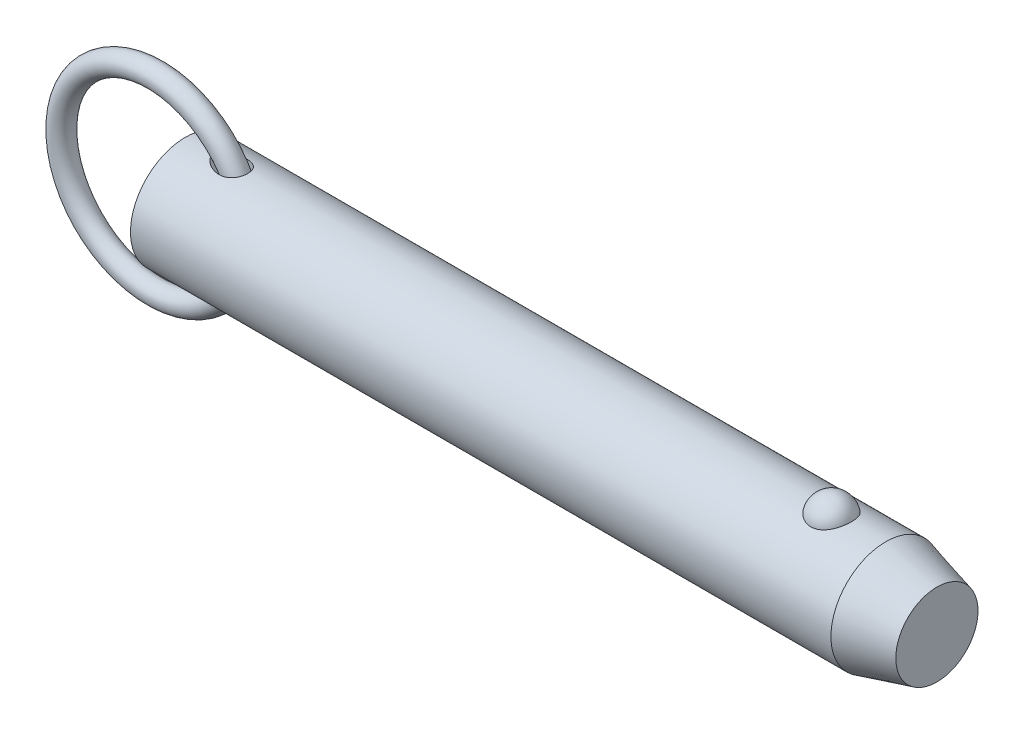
ISO-10303-21;
HEADER;
FILE_DESCRIPTION(('STEP AP214'),'2;1');
FILE_NAME('part.step','',(''),(''),'','','');
FILE_SCHEMA(('AUTOMOTIVE_DESIGN { 1 0 10303 214 1 1 1 1 }'));
ENDSEC;
DATA;
#1=APPLICATION_CONTEXT('core data for automotive mechanical design processes');
#2=APPLICATION_PROTOCOL_DEFINITION('international standard','automotive_design',2000,#1);
#3=PRODUCT_CONTEXT('',#1,'mechanical');
#4=PRODUCT('Part','Part','',(#3));
#5=PRODUCT_RELATED_PRODUCT_CATEGORY('part','',(#4));
#6=PRODUCT_DEFINITION_FORMATION('','',#4);
#7=PRODUCT_DEFINITION_CONTEXT('part definition',#1,'design');
#8=PRODUCT_DEFINITION('design','',#6,#7);
#9=PRODUCT_DEFINITION_SHAPE('','',#8);
#10=(LENGTH_UNIT() NAMED_UNIT(*) SI_UNIT(.MILLI.,.METRE.));
#11=(NAMED_UNIT(*) PLANE_ANGLE_UNIT() SI_UNIT($,.RADIAN.));
#12=(NAMED_UNIT(*) SI_UNIT($,.STERADIAN.) SOLID_ANGLE_UNIT());
#13=UNCERTAINTY_MEASURE_WITH_UNIT(LENGTH_MEASURE(1.E-05),#10,'distance_accuracy_value','');
#14=(GEOMETRIC_REPRESENTATION_CONTEXT(3) GLOBAL_UNCERTAINTY_ASSIGNED_CONTEXT((#13)) GLOBAL_UNIT_ASSIGNED_CONTEXT((#10,
#11,#12)) REPRESENTATION_CONTEXT('',''));
#15=CARTESIAN_POINT('',(0.,0.,0.));
#16=DIRECTION('',(0.,0.,1.));
#17=DIRECTION('',(1.,0.,0.));
#18=AXIS2_PLACEMENT_3D('',#15,#16,#17);
#19=CARTESIAN_POINT('',(-6.08699288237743,0.,0.));
#20=DIRECTION('',(0.,0.,1.));
#21=DIRECTION('',(1.,0.,0.));
#22=AXIS2_PLACEMENT_3D('',#19,#20,#21);
#23=TOROIDAL_SURFACE('',#22,19.05,2.223);
#24=CARTESIAN_POINT('',(15.1860071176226,0.,0.));
#25=VERTEX_POINT('',#24);
#26=VERTEX_LOOP('',#25);
#27=FACE_BOUND('',#26,.T.);
#28=ADVANCED_FACE('P0_F12',(#27),#23,.T.);
#29=CLOSED_SHELL('',(#28));
#30=MANIFOLD_SOLID_BREP('P0_B1',#29);
#31=CARTESIAN_POINT('',(0.,0.,0.));
#32=DIRECTION('',(1.,0.,0.));
#33=DIRECTION('',(0.,0.,-1.));
#34=AXIS2_PLACEMENT_3D('',#31,#32,#33);
#35=CYLINDRICAL_SURFACE('',#34,11.115);
#36=CARTESIAN_POINT('',(6.414051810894,11.0227946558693,-1.4287136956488));
#37=CARTESIAN_POINT('',(6.49338916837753,11.0115377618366,-1.51556642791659));
#38=CARTESIAN_POINT('',(6.57765461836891,10.9998263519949,-1.59789397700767));
#39=CARTESIAN_POINT('',(6.75386647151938,10.9760304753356,-1.75391400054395));
#40=CARTESIAN_POINT('',(6.84582247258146,10.9639455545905,-1.82759540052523));
#41=CARTESIAN_POINT('',(7.03627827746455,10.9397989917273,-1.96698954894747));
#42=CARTESIAN_POINT('',(7.13480838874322,10.9277377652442,-2.03266078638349));
#43=CARTESIAN_POINT('',(7.33681032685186,10.9041015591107,-2.1558582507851));
#44=CARTESIAN_POINT('',(7.44028007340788,10.8925263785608,-2.21338786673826));
#45=CARTESIAN_POINT('',(7.64386117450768,10.8710104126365,-2.31666528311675));
#46=CARTESIAN_POINT('',(7.74368989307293,10.8610119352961,-2.36295942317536));
#47=CARTESIAN_POINT('',(7.94637195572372,10.8420168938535,-2.44863486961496));
#48=CARTESIAN_POINT('',(8.04922612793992,10.8330206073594,-2.48801426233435));
#49=CARTESIAN_POINT('',(8.36115573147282,10.807980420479,-2.59542730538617));
#50=CARTESIAN_POINT('',(8.57411849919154,10.7938278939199,-2.65299817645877));
#51=CARTESIAN_POINT('',(9.00825016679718,10.7725818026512,-2.73800108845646));
#52=CARTESIAN_POINT('',(9.22947335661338,10.7655491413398,-2.76517330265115));
#53=CARTESIAN_POINT('',(9.67368141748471,10.7605872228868,-2.78445308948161));
#54=CARTESIAN_POINT('',(9.89666486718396,10.7626512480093,-2.77658653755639));
#55=CARTESIAN_POINT('',(10.2950172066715,10.7754452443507,-2.72644436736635));
#56=CARTESIAN_POINT('',(10.4712789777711,10.7844280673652,-2.69109376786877));
#57=CARTESIAN_POINT('',(10.7292776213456,10.8024982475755,-2.61722365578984));
#58=CARTESIAN_POINT('',(10.8142337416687,10.8092901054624,-2.58911576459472));
#59=CARTESIAN_POINT('',(10.9813218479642,10.8242580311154,-2.52581287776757));
#60=CARTESIAN_POINT('',(11.0634550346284,10.8324335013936,-2.49062094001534));
#61=CARTESIAN_POINT('',(11.2247418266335,10.8500287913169,-2.41281958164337));
#62=CARTESIAN_POINT('',(11.3038694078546,10.8594572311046,-2.37015806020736));
#63=CARTESIAN_POINT('',(11.4576781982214,10.8792243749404,-2.27770403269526));
#64=CARTESIAN_POINT('',(11.5323615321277,10.8895626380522,-2.22791497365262));
#65=CARTESIAN_POINT('',(11.6765388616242,10.9108113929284,-2.12140590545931));
#66=CARTESIAN_POINT('',(11.7460329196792,10.9217218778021,-2.06468597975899));
#67=CARTESIAN_POINT('',(11.8790597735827,10.9437207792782,-1.94471764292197));
#68=CARTESIAN_POINT('',(11.9425932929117,10.9548091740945,-1.88147002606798));
#69=CARTESIAN_POINT('',(12.109388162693,10.9851999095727,-1.69784918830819));
#70=CARTESIAN_POINT('',(12.205655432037,11.0042655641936,-1.57093023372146));
#71=CARTESIAN_POINT('',(12.374151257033,11.0393391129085,-1.3017676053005));
#72=CARTESIAN_POINT('',(12.4463875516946,11.0553479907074,-1.15952888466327));
#73=CARTESIAN_POINT('',(12.5615818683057,11.0816338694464,-0.87197217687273));
#74=CARTESIAN_POINT('',(12.6058896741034,11.0921698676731,-0.727217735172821));
#75=CARTESIAN_POINT('',(12.6699315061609,11.1075802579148,-0.432089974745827));
#76=CARTESIAN_POINT('',(12.6896681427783,11.1124552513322,-0.281717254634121));
#77=CARTESIAN_POINT('',(12.7040225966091,11.1159901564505,0.0188164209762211));
#78=CARTESIAN_POINT('',(12.6988836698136,11.1147102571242,0.168965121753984));
#79=CARTESIAN_POINT('',(12.6641681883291,11.1062126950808,0.466238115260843));
#80=CARTESIAN_POINT('',(12.6345920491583,11.0989951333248,0.613362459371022));
#81=CARTESIAN_POINT('',(12.5517453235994,11.0794095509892,0.900330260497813));
#82=CARTESIAN_POINT('',(12.4984878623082,11.0670443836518,1.0401777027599));
#83=CARTESIAN_POINT('',(12.3696588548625,11.0385082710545,1.308745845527));
#84=CARTESIAN_POINT('',(12.2940887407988,11.0223375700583,1.43746725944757));
#85=CARTESIAN_POINT('',(12.122380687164,10.987872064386,1.68079704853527));
#86=CARTESIAN_POINT('',(12.0261637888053,10.969569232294,1.79534850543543));
#87=CARTESIAN_POINT('',(11.8161707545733,10.932836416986,2.00695695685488));
#88=CARTESIAN_POINT('',(11.7023941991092,10.9144064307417,2.10401353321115));
#89=CARTESIAN_POINT('',(11.4575656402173,10.8788057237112,2.2810532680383));
#90=CARTESIAN_POINT('',(11.3261451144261,10.8616794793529,2.36053412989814));
#91=CARTESIAN_POINT('',(11.0523589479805,10.8308019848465,2.49839044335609));
#92=CARTESIAN_POINT('',(10.9099908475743,10.8170514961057,2.55676113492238));
#93=CARTESIAN_POINT('',(10.6060622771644,10.7929728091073,2.65666105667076));
#94=CARTESIAN_POINT('',(10.4438877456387,10.7830209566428,2.69640163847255));
#95=CARTESIAN_POINT('',(10.1154037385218,10.7687230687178,2.75293129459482));
#96=CARTESIAN_POINT('',(9.94909141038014,10.7643810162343,2.76970406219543));
#97=CARTESIAN_POINT('',(9.54387061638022,10.7604809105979,2.7848723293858));
#98=CARTESIAN_POINT('',(9.30446860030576,10.7637793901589,2.77227753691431));
#99=CARTESIAN_POINT('',(8.94961255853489,10.7757341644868,2.72524141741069));
#100=CARTESIAN_POINT('',(8.83186896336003,10.7808994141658,2.70482239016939));
#101=CARTESIAN_POINT('',(8.59835142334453,10.7932548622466,2.65509992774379));
#102=CARTESIAN_POINT('',(8.48257728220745,10.8004448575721,2.62579738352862));
#103=CARTESIAN_POINT('',(8.2520846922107,10.8166382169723,2.55827624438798));
#104=CARTESIAN_POINT('',(8.1374021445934,10.8256649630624,2.51994155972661));
#105=CARTESIAN_POINT('',(7.91132058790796,10.8451170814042,2.43486475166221));
#106=CARTESIAN_POINT('',(7.79992154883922,10.8555424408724,2.38812270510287));
#107=CARTESIAN_POINT('',(7.58115677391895,10.8774251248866,2.28638483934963));
#108=CARTESIAN_POINT('',(7.47378802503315,10.8888816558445,2.2313953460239));
#109=CARTESIAN_POINT('',(7.26385624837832,10.9124540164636,2.11310265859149));
#110=CARTESIAN_POINT('',(7.16129168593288,10.9245696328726,2.04980214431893));
#111=CARTESIAN_POINT('',(6.91882218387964,10.9543689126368,1.88540538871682));
#112=CARTESIAN_POINT('',(6.78193778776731,10.9721958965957,1.77979827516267));
#113=CARTESIAN_POINT('',(6.52472441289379,11.0070222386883,1.5498969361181));
#114=CARTESIAN_POINT('',(6.40436902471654,11.0240228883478,1.42563320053));
#115=CARTESIAN_POINT('',(6.21838804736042,11.0509658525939,1.19529359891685));
#116=CARTESIAN_POINT('',(6.14691885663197,11.0615430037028,1.09404520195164));
#117=CARTESIAN_POINT('',(6.02043496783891,11.0805004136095,0.881508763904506));
#118=CARTESIAN_POINT('',(5.96539400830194,11.0888841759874,0.770237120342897));
#119=CARTESIAN_POINT('',(5.88475453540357,11.1012553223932,0.560577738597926));
#120=CARTESIAN_POINT('',(5.85559643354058,11.1057686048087,0.463603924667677));
#121=CARTESIAN_POINT('',(5.81381299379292,11.1122523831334,0.26608330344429));
#122=CARTESIAN_POINT('',(5.80117118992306,11.1142254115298,0.165540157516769));
#123=CARTESIAN_POINT('',(5.79363815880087,11.1153999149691,-0.0364747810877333));
#124=CARTESIAN_POINT('',(5.79878799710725,11.1145949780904,-0.137948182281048));
#125=CARTESIAN_POINT('',(5.82639592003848,11.1102987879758,-0.338493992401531));
#126=CARTESIAN_POINT('',(5.84887234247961,11.1068046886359,-0.437563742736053));
#127=CARTESIAN_POINT('',(5.91510741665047,11.0965857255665,-0.649968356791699));
#128=CARTESIAN_POINT('',(5.9622090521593,11.0893566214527,-0.762222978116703));
#129=CARTESIAN_POINT('',(6.07378449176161,11.072471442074,-0.977396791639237));
#130=CARTESIAN_POINT('',(6.13826787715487,11.0628140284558,-1.08031079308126));
#131=CARTESIAN_POINT('',(6.24101077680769,11.0477136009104,-1.2219580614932));
#132=CARTESIAN_POINT('',(6.27403486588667,11.042895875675,-1.26469183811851));
#133=CARTESIAN_POINT('',(6.34238022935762,11.0330152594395,-1.34817011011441));
#134=CARTESIAN_POINT('',(6.37769867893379,11.0279526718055,-1.38891694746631));
#135=CARTESIAN_POINT('',(6.414051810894,11.0227946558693,-1.4287136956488));
#136=B_SPLINE_CURVE_WITH_KNOTS('',3,(#36,#37,#38,#39,#40,#41,#42,#43,#44,#45,#46,#47,#48,#49,
#50,#51,#52,#53,#54,#55,#56,#57,#58,#59,#60,#61,#62,#63,#64,#65,#66,#67,#68,#69,#70,#71,#72,#73,
#74,#75,#76,#77,#78,#79,#80,#81,#82,#83,#84,#85,#86,#87,#88,#89,#90,#91,#92,#93,#94,#95,#96,#97,
#98,#99,#100,#101,#102,#103,#104,#105,#106,#107,#108,#109,#110,#111,#112,#113,#114,#115,#116,
#117,#118,#119,#120,#121,#122,#123,#124,#125,#126,#127,#128,#129,#130,#131,#132,#133,#134,#135),
.UNSPECIFIED.,.T.,.F.,(4,2,2,2,2,2,2,2,2,2,2,2,2,2,2,2,2,2,2,2,2,2,2,2,2,2,2,2,2,2,2,2,2,2,2,2,
2,2,2,2,2,2,2,2,2,2,2,2,2,4),(0.,0.35443329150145,0.709315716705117,1.0659654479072,
1.42246628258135,1.7536715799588,2.08496839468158,2.74582009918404,3.41227815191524,
4.07824412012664,4.61583787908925,4.88478112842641,5.1536085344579,5.42439170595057,
5.69504436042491,5.96569375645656,6.23631025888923,6.71490729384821,7.19335005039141,
7.64641437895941,8.09943057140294,8.54802575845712,8.99661331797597,9.44495256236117,
9.89326303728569,10.3433195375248,10.7933867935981,11.2550086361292,11.7167345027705,
12.2165866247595,12.7167934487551,13.4318876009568,13.7904664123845,14.1490092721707,
14.5124394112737,14.8758662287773,15.239015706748,15.6020483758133,16.1219860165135,
16.6410830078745,17.0130520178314,17.3844231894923,17.6872330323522,17.9897407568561,
18.2929471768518,18.5964749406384,18.9603532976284,19.3244326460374,19.4870338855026,
19.649438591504),.UNSPECIFIED.);
#137=CARTESIAN_POINT('',(6.414051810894,11.0227946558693,-1.4287136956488));
#138=VERTEX_POINT('',#137);
#139=EDGE_CURVE('P1_E40',#138,#138,#136,.T.);
#140=ORIENTED_EDGE('',*,*,#139,.T.);
#141=EDGE_LOOP('',(#140));
#142=FACE_BOUND('',#141,.T.);
#143=CARTESIAN_POINT('',(142.029563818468,0.,0.));
#144=DIRECTION('',(1.,0.,0.));
#145=DIRECTION('',(0.,0.,-1.));
#146=AXIS2_PLACEMENT_3D('',#143,#144,#145);
#147=CIRCLE('',#146,11.115);
#148=CARTESIAN_POINT('',(142.029563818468,0.,-11.115));
#149=VERTEX_POINT('',#148);
#150=EDGE_CURVE('P1_E25',#149,#149,#147,.T.);
#151=ORIENTED_EDGE('',*,*,#150,.F.);
#152=EDGE_LOOP('',(#151));
#153=FACE_BOUND('',#152,.T.);
#154=CARTESIAN_POINT('',(0.,0.,0.));
#155=DIRECTION('',(1.,0.,0.));
#156=DIRECTION('',(0.,0.,-1.));
#157=AXIS2_PLACEMENT_3D('',#154,#155,#156);
#158=CIRCLE('',#157,11.115);
#159=CARTESIAN_POINT('',(0.,0.,-11.115));
#160=VERTEX_POINT('',#159);
#161=EDGE_CURVE('P1_E9',#160,#160,#158,.T.);
#162=ORIENTED_EDGE('',*,*,#161,.T.);
#163=EDGE_LOOP('',(#162));
#164=FACE_BOUND('',#163,.T.);
#165=CARTESIAN_POINT('',(131.031068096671,10.3028087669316,4.17077409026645));
#166=CARTESIAN_POINT('',(130.814775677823,10.3028003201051,4.17078240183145));
#167=CARTESIAN_POINT('',(130.598548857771,10.3098895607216,4.15340593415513));
#168=CARTESIAN_POINT('',(130.172540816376,10.3373834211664,4.08449540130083));
#169=CARTESIAN_POINT('',(129.962757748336,10.3577841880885,4.0329712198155));
#170=CARTESIAN_POINT('',(129.555782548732,10.4095237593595,3.89746513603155));
#171=CARTESIAN_POINT('',(129.358572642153,10.4408466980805,3.81353029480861));
#172=CARTESIAN_POINT('',(128.981338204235,10.5110236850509,3.61560339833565));
#173=CARTESIAN_POINT('',(128.801317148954,10.5498792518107,3.50160528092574));
#174=CARTESIAN_POINT('',(128.457684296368,10.6322884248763,3.24292464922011));
#175=CARTESIAN_POINT('',(128.294686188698,10.6759443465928,3.09746040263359));
#176=CARTESIAN_POINT('',(127.994591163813,10.7625291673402,2.7817192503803));
#177=CARTESIAN_POINT('',(127.857499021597,10.8054579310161,2.61143778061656));
#178=CARTESIAN_POINT('',(127.606408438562,10.8881935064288,2.24226695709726));
#179=CARTESIAN_POINT('',(127.493710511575,10.9277761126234,2.04244123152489));
#180=CARTESIAN_POINT('',(127.301777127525,10.997484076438,1.62578254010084));
#181=CARTESIAN_POINT('',(127.222544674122,11.0276085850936,1.40894804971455));
#182=CARTESIAN_POINT('',(127.098303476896,11.0756732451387,0.961250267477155));
#183=CARTESIAN_POINT('',(127.053760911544,11.0934470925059,0.730239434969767));
#184=CARTESIAN_POINT('',(127.001569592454,11.1143331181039,0.26343964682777));
#185=CARTESIAN_POINT('',(126.993920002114,11.1174456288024,0.0276507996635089));
#186=CARTESIAN_POINT('',(127.01561056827,11.1087161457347,-0.440729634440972));
#187=CARTESIAN_POINT('',(127.044762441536,11.0969502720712,-0.6733313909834));
#188=CARTESIAN_POINT('',(127.139143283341,11.0597872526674,-1.12996621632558));
#189=CARTESIAN_POINT('',(127.204372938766,11.0343898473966,-1.35399912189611));
#190=CARTESIAN_POINT('',(127.36969844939,10.972515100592,-1.78750286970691));
#191=CARTESIAN_POINT('',(127.46983863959,10.9360236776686,-1.99695478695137));
#192=CARTESIAN_POINT('',(127.702940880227,10.8557595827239,-2.39520667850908));
#193=CARTESIAN_POINT('',(127.835905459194,10.8119863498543,-2.58400506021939));
#194=CARTESIAN_POINT('',(128.132407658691,10.7216733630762,-2.93635726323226));
#195=CARTESIAN_POINT('',(128.296056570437,10.675123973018,-3.09981510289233));
#196=CARTESIAN_POINT('',(128.649860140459,10.5846571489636,-3.39592247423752));
#197=CARTESIAN_POINT('',(128.840012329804,10.5407394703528,-3.52857487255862));
#198=CARTESIAN_POINT('',(129.23750141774,10.4616690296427,-3.75646057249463));
#199=CARTESIAN_POINT('',(129.44436705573,10.4263443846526,-3.85245432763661));
#200=CARTESIAN_POINT('',(129.872954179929,10.3675574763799,-4.00798747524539));
#201=CARTESIAN_POINT('',(130.094670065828,10.344090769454,-4.0675405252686));
#202=CARTESIAN_POINT('',(130.534669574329,10.3128282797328,-4.14614314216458));
#203=CARTESIAN_POINT('',(130.752565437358,10.3043040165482,-4.1670783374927));
#204=CARTESIAN_POINT('',(131.18894951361,10.3016771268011,-4.17357158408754));
#205=CARTESIAN_POINT('',(131.407437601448,10.3075716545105,-4.15913661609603));
#206=CARTESIAN_POINT('',(131.831744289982,10.3326686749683,-4.09636961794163));
#207=CARTESIAN_POINT('',(132.037745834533,10.3514555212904,-4.0490957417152));
#208=CARTESIAN_POINT('',(132.438576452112,10.399818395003,-3.92320197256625));
#209=CARTESIAN_POINT('',(132.6334046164,10.4293952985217,-3.84457953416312));
#210=CARTESIAN_POINT('',(133.011191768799,10.4969600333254,-3.65612410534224));
#211=CARTESIAN_POINT('',(133.193797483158,10.5351178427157,-3.54564545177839));
#212=CARTESIAN_POINT('',(133.538204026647,10.6154999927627,-3.29718036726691));
#213=CARTESIAN_POINT('',(133.700000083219,10.657725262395,-3.15918764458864));
#214=CARTESIAN_POINT('',(134.006959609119,10.744212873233,-2.85163580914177));
#215=CARTESIAN_POINT('',(134.150891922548,10.7884718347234,-2.68084605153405));
#216=CARTESIAN_POINT('',(134.409237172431,10.872374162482,-2.31721864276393));
#217=CARTESIAN_POINT('',(134.523644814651,10.9120167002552,-2.12437704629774));
#218=CARTESIAN_POINT('',(134.723873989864,10.9838919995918,-1.71516999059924));
#219=CARTESIAN_POINT('',(134.80866178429,11.0158465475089,-1.49824866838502));
#220=CARTESIAN_POINT('',(134.94268382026,11.0673523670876,-1.05228572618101));
#221=CARTESIAN_POINT('',(134.991917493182,11.086903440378,-0.823243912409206));
#222=CARTESIAN_POINT('',(135.053891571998,11.1116323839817,-0.359087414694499));
#223=CARTESIAN_POINT('',(135.066566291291,11.1167843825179,-0.123962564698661));
#224=CARTESIAN_POINT('',(135.054973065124,11.1121144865,0.345220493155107));
#225=CARTESIAN_POINT('',(135.030705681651,11.1022928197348,0.579278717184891));
#226=CARTESIAN_POINT('',(134.945907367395,11.0687504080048,1.03866534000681));
#227=CARTESIAN_POINT('',(134.885529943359,11.0450885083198,1.26402641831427));
#228=CARTESIAN_POINT('',(134.729853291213,10.9863185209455,1.70076772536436));
#229=CARTESIAN_POINT('',(134.634551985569,10.9512097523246,1.91214712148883));
#230=CARTESIAN_POINT('',(134.410397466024,10.8729733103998,2.316083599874));
#231=CARTESIAN_POINT('',(134.281380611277,10.8298068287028,2.50854240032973));
#232=CARTESIAN_POINT('',(133.992732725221,10.7401896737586,2.86808766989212));
#233=CARTESIAN_POINT('',(133.833102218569,10.6937390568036,3.03517457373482));
#234=CARTESIAN_POINT('',(133.487534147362,10.6029321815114,3.33857581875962));
#235=CARTESIAN_POINT('',(133.301708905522,10.5585680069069,3.47501541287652));
#236=CARTESIAN_POINT('',(132.907875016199,10.4769321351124,3.71390897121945));
#237=CARTESIAN_POINT('',(132.699863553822,10.439661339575,3.81635861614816));
#238=CARTESIAN_POINT('',(132.254066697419,10.3749407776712,3.98910631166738));
#239=CARTESIAN_POINT('',(132.015234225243,10.3482457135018,4.05700929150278));
#240=CARTESIAN_POINT('',(131.527925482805,10.312188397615,4.14782844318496));
#241=CARTESIAN_POINT('',(131.279453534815,10.3028184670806,4.17076454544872));
#242=CARTESIAN_POINT('',(131.031068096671,10.3028087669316,4.17077409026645));
#243=B_SPLINE_CURVE_WITH_KNOTS('',3,(#165,#166,#167,#168,#169,#170,#171,#172,#173,#174,#175,
#176,#177,#178,#179,#180,#181,#182,#183,#184,#185,#186,#187,#188,#189,#190,#191,#192,#193,#194,
#195,#196,#197,#198,#199,#200,#201,#202,#203,#204,#205,#206,#207,#208,#209,#210,#211,#212,#213,
#214,#215,#216,#217,#218,#219,#220,#221,#222,#223,#224,#225,#226,#227,#228,#229,#230,#231,#232,
#233,#234,#235,#236,#237,#238,#239,#240,#241,#242),.UNSPECIFIED.,.T.,.F.,(4,2,2,2,2,2,2,2,2,2,2,
2,2,2,2,2,2,2,2,2,2,2,2,2,2,2,2,2,2,2,2,2,2,2,2,2,2,2,4),(0.,0.64796614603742,1.29574482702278,
1.94258643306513,2.58955857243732,3.25496465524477,3.92049326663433,4.61566368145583,
5.31089647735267,6.01531821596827,6.71972398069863,7.42054043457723,8.12137023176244,
8.82309331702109,9.52487047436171,10.2292439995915,10.9335519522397,11.6223330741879,
12.3108558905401,12.9647664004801,13.6185478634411,14.252184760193,14.8858731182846,
15.5334360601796,16.1811472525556,16.8611459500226,17.5412664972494,18.2431855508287,
18.9451158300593,19.6483065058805,20.3514864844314,21.0516982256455,21.7519516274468,
22.4556690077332,23.1593743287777,23.8601491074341,24.5610129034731,25.3054529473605,
26.049562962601),.UNSPECIFIED.);
#244=CARTESIAN_POINT('',(131.031068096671,10.3028087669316,4.17077409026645));
#245=VERTEX_POINT('',#244);
#246=EDGE_CURVE('P1_E34',#245,#245,#243,.T.);
#247=ORIENTED_EDGE('',*,*,#246,.T.);
#248=EDGE_LOOP('',(#247));
#249=FACE_BOUND('',#248,.T.);
#250=CARTESIAN_POINT('',(6.414051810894,-11.0227946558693,-1.4287136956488));
#251=CARTESIAN_POINT('',(6.33124061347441,-11.0345445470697,-1.33806125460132));
#252=CARTESIAN_POINT('',(6.25372866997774,-11.0458090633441,-1.24240732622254));
#253=CARTESIAN_POINT('',(6.11277905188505,-11.0666115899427,-1.04095704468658));
#254=CARTESIAN_POINT('',(6.04933920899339,-11.0761498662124,-0.935162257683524));
#255=CARTESIAN_POINT('',(5.94029181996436,-11.0927063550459,-0.712476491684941));
#256=CARTESIAN_POINT('',(5.89492964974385,-11.0996897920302,-0.595457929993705));
#257=CARTESIAN_POINT('',(5.8449816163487,-11.1074141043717,-0.414997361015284));
#258=CARTESIAN_POINT('',(5.83135004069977,-11.1095300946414,-0.354047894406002));
#259=CARTESIAN_POINT('',(5.81051649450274,-11.1127688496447,-0.231041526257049));
#260=CARTESIAN_POINT('',(5.80331311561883,-11.1138918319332,-0.1689848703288));
#261=CARTESIAN_POINT('',(5.79296529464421,-11.1155042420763,-0.000484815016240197));
#262=CARTESIAN_POINT('',(5.79625267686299,-11.1149904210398,0.106437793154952));
#263=CARTESIAN_POINT('',(5.82213676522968,-11.1109609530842,0.317809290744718));
#264=CARTESIAN_POINT('',(5.84474662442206,-11.1074432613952,0.422256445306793));
#265=CARTESIAN_POINT('',(5.91113114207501,-11.097197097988,0.639361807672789));
#266=CARTESIAN_POINT('',(5.95733120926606,-11.090102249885,0.751250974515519));
#267=CARTESIAN_POINT('',(6.06709542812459,-11.0734770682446,0.965912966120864));
#268=CARTESIAN_POINT('',(6.13068735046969,-11.06394284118,1.06867085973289));
#269=CARTESIAN_POINT('',(6.30294237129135,-11.0385920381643,1.30890635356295));
#270=CARTESIAN_POINT('',(6.4189620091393,-11.0218881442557,1.44097376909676));
#271=CARTESIAN_POINT('',(6.66989654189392,-10.9871512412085,1.68553954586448));
#272=CARTESIAN_POINT('',(6.80485520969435,-10.9691152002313,1.79799117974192));
#273=CARTESIAN_POINT('',(7.04881236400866,-10.9382283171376,1.97587596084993));
#274=CARTESIAN_POINT('',(7.15465712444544,-10.9253240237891,2.04570822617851));
#275=CARTESIAN_POINT('',(7.37202504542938,-10.9000987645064,2.17611840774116));
#276=CARTESIAN_POINT('',(7.48355057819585,-10.8877780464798,2.23669241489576));
#277=CARTESIAN_POINT('',(7.71132418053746,-10.8641580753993,2.34873831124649));
#278=CARTESIAN_POINT('',(7.82757727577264,-10.8528599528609,2.40020018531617));
#279=CARTESIAN_POINT('',(8.06386825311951,-10.8317234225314,2.49385169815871));
#280=CARTESIAN_POINT('',(8.18390558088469,-10.8218848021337,2.53604268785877));
#281=CARTESIAN_POINT('',(8.42918336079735,-10.8039208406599,2.61152283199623));
#282=CARTESIAN_POINT('',(8.55447802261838,-10.7958283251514,2.64464414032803));
#283=CARTESIAN_POINT('',(8.80752127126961,-10.781995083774,2.70048793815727));
#284=CARTESIAN_POINT('',(8.93527019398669,-10.7762546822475,2.72320899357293));
#285=CARTESIAN_POINT('',(9.19210176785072,-10.7675291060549,2.75750994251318));
#286=CARTESIAN_POINT('',(9.32118105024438,-10.7645381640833,2.76911315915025));
#287=CARTESIAN_POINT('',(9.57984338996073,-10.761622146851,2.78042035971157));
#288=CARTESIAN_POINT('',(9.70942621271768,-10.7616957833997,2.78012934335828));
#289=CARTESIAN_POINT('',(10.0243125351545,-10.7659059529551,2.76381534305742));
#290=CARTESIAN_POINT('',(10.209307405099,-10.7717977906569,2.74099674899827));
#291=CARTESIAN_POINT('',(10.5731188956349,-10.7905408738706,2.66626238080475));
#292=CARTESIAN_POINT('',(10.7519389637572,-10.8033881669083,2.61436313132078));
#293=CARTESIAN_POINT('',(11.0114289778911,-10.8271584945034,2.51336808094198));
#294=CARTESIAN_POINT('',(11.0968318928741,-10.835881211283,2.47562331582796));
#295=CARTESIAN_POINT('',(11.2636000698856,-10.8545688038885,2.39236170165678));
#296=CARTESIAN_POINT('',(11.344967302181,-10.8645330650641,2.34684869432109));
#297=CARTESIAN_POINT('',(11.5027832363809,-10.8853818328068,2.24815967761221));
#298=CARTESIAN_POINT('',(11.5792327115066,-10.8962661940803,2.19498487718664));
#299=CARTESIAN_POINT('',(11.7263315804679,-10.9185541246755,2.08128855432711));
#300=CARTESIAN_POINT('',(11.7969818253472,-10.9299576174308,2.02076811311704));
#301=CARTESIAN_POINT('',(11.9817953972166,-10.9613645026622,1.84513663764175));
#302=CARTESIAN_POINT('',(12.0893012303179,-10.9814643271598,1.72286660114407));
#303=CARTESIAN_POINT('',(12.2803576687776,-11.0193991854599,1.46066991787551));
#304=CARTESIAN_POINT('',(12.3639173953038,-11.0372350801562,1.32075002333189));
#305=CARTESIAN_POINT('',(12.4996220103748,-11.0672969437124,1.03778067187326));
#306=CARTESIAN_POINT('',(12.5535315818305,-11.0798242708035,0.895607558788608));
#307=CARTESIAN_POINT('',(12.636874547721,-11.0995427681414,0.603918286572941));
#308=CARTESIAN_POINT('',(12.6663115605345,-11.1067347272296,0.454403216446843));
#309=CARTESIAN_POINT('',(12.6997387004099,-11.1149224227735,0.154577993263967));
#310=CARTESIAN_POINT('',(12.7040886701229,-11.1160057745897,0.00431019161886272));
#311=CARTESIAN_POINT('',(12.6882048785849,-11.1120956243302,-0.294841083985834));
#312=CARTESIAN_POINT('',(12.6679715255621,-11.1071022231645,-0.443724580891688));
#313=CARTESIAN_POINT('',(12.6034470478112,-11.0915888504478,-0.735688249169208));
#314=CARTESIAN_POINT('',(12.5591858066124,-11.0810757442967,-0.878775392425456));
#315=CARTESIAN_POINT('',(12.4477416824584,-11.0556687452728,-1.1552952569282));
#316=CARTESIAN_POINT('',(12.3805601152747,-11.0407751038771,-1.28872853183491));
#317=CARTESIAN_POINT('',(12.2248919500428,-11.0081839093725,-1.54257976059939));
#318=CARTESIAN_POINT('',(12.1363549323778,-10.9904797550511,-1.66296592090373));
#319=CARTESIAN_POINT('',(11.9406137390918,-10.9541951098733,-1.88726577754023));
#320=CARTESIAN_POINT('',(11.833409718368,-10.9356146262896,-1.99117961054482));
#321=CARTESIAN_POINT('',(11.601318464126,-10.8991360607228,-2.18213646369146));
#322=CARTESIAN_POINT('',(11.4761325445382,-10.8812577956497,-2.26881927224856));
#323=CARTESIAN_POINT('',(11.2134852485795,-10.8482871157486,-2.42157282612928));
#324=CARTESIAN_POINT('',(11.0760218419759,-10.8331951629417,-2.48764015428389));
#325=CARTESIAN_POINT('',(10.7828968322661,-10.8061050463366,-2.60290068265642));
#326=CARTESIAN_POINT('',(10.6266338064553,-10.7943907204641,-2.65062248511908));
#327=CARTESIAN_POINT('',(10.3086617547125,-10.7762429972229,-2.72345054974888));
#328=CARTESIAN_POINT('',(10.146948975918,-10.7698133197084,-2.74854088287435));
#329=CARTESIAN_POINT('',(9.75541304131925,-10.7608036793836,-2.78368719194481));
#330=CARTESIAN_POINT('',(9.52459435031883,-10.7608467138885,-2.78350276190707));
#331=CARTESIAN_POINT('',(9.0660496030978,-10.7702674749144,-2.74677945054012));
#332=CARTESIAN_POINT('',(8.83832966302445,-10.7796615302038,-2.71017697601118));
#333=CARTESIAN_POINT('',(8.38783466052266,-10.8058248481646,-2.60392490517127));
#334=CARTESIAN_POINT('',(8.16517101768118,-10.8226939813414,-2.53382676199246));
#335=CARTESIAN_POINT('',(7.84087311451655,-10.8516548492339,-2.40555545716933));
#336=CARTESIAN_POINT('',(7.73435551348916,-10.8619221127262,-2.35892455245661));
#337=CARTESIAN_POINT('',(7.52510420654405,-10.883357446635,-2.25797017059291));
#338=CARTESIAN_POINT('',(7.42236986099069,-10.8945253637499,-2.20364800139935));
#339=CARTESIAN_POINT('',(7.23808758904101,-10.915528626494,-2.09688018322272));
#340=CARTESIAN_POINT('',(7.15584631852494,-10.9252787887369,-2.04561072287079));
#341=CARTESIAN_POINT('',(6.99510576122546,-10.944960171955,-1.93754729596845));
#342=CARTESIAN_POINT('',(6.91660574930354,-10.9548913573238,-1.88075440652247));
#343=CARTESIAN_POINT('',(6.76418133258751,-10.974690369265,-1.7615450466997));
#344=CARTESIAN_POINT('',(6.69024940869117,-10.984558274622,-1.69913825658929));
#345=CARTESIAN_POINT('',(6.54780119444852,-11.0039826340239,-1.56842485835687));
#346=CARTESIAN_POINT('',(6.47928247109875,-11.0135392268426,-1.50012092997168));
#347=CARTESIAN_POINT('',(6.414051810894,-11.0227946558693,-1.4287136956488));
#348=B_SPLINE_CURVE_WITH_KNOTS('',3,(#250,#251,#252,#253,#254,#255,#256,#257,#258,#259,#260,
#261,#262,#263,#264,#265,#266,#267,#268,#269,#270,#271,#272,#273,#274,#275,#276,#277,#278,#279,
#280,#281,#282,#283,#284,#285,#286,#287,#288,#289,#290,#291,#292,#293,#294,#295,#296,#297,#298,
#299,#300,#301,#302,#303,#304,#305,#306,#307,#308,#309,#310,#311,#312,#313,#314,#315,#316,#317,
#318,#319,#320,#321,#322,#323,#324,#325,#326,#327,#328,#329,#330,#331,#332,#333,#334,#335,#336,
#337,#338,#339,#340,#341,#342,#343,#344,#345,#346,#347),.UNSPECIFIED.,.T.,.F.,(4,2,2,2,2,2,2,2,
2,2,2,2,2,2,2,2,2,2,2,2,2,2,2,2,2,2,2,2,2,2,2,2,2,2,2,2,2,2,2,2,2,2,2,2,2,2,2,2,4),(0.,
0.36983565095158,0.739614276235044,1.1142538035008,1.30141910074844,1.48854338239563,
1.8074587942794,2.12659146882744,2.4883888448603,2.85076733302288,3.3776216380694,
3.90571433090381,4.287639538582,4.66972556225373,5.05222896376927,5.43467659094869,
5.82378546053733,6.21294796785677,6.6012922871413,6.98947336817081,7.54669558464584,
8.10360148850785,8.3845853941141,8.66543074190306,8.94623182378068,9.22699162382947,
9.71628887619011,10.2053995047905,10.6608871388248,11.1163074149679,11.5651786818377,
12.0140424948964,12.4623493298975,12.9106304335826,13.3599804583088,13.8093267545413,
14.2672570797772,14.7252632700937,15.214740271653,15.7045615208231,16.3932594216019,
17.083162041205,17.7825738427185,18.1325177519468,18.4824022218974,18.7744056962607,
19.0663523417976,19.3578048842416,19.6491256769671),.UNSPECIFIED.);
#349=CARTESIAN_POINT('',(6.414051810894,-11.0227946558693,-1.4287136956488));
#350=VERTEX_POINT('',#349);
#351=EDGE_CURVE('P1_E17',#350,#350,#348,.T.);
#352=ORIENTED_EDGE('',*,*,#351,.T.);
#353=EDGE_LOOP('',(#352));
#354=FACE_BOUND('',#353,.T.);
#355=ADVANCED_FACE('P1_F13',(#142,#153,#164,#249,#354),#35,.T.);
#356=CARTESIAN_POINT('',(0.,0.,0.));
#357=DIRECTION('',(-1.,0.,0.));
#358=DIRECTION('',(0.,0.,1.));
#359=AXIS2_PLACEMENT_3D('',#356,#357,#358);
#360=PLANE('',#359);
#361=ORIENTED_EDGE('',*,*,#161,.F.);
#362=EDGE_LOOP('',(#361));
#363=FACE_BOUND('',#362,.T.);
#364=ADVANCED_FACE('P1_F15',(#363),#360,.T.);
#365=CARTESIAN_POINT('',(152.4,0.,0.));
#366=DIRECTION('',(-1.,0.,0.));
#367=DIRECTION('',(0.,0.,1.));
#368=AXIS2_PLACEMENT_3D('',#365,#366,#367);
#369=CONICAL_SURFACE('',#368,8.33625000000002,0.26179938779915);
#370=ORIENTED_EDGE('',*,*,#150,.T.);
#371=EDGE_LOOP('',(#370));
#372=FACE_BOUND('',#371,.T.);
#373=CARTESIAN_POINT('',(152.4,0.,0.));
#374=DIRECTION('',(1.,0.,0.));
#375=DIRECTION('',(0.,0.,-1.));
#376=AXIS2_PLACEMENT_3D('',#373,#374,#375);
#377=CIRCLE('',#376,8.33625000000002);
#378=CARTESIAN_POINT('',(152.4,0.,-8.33625000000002));
#379=VERTEX_POINT('',#378);
#380=EDGE_CURVE('P1_E30',#379,#379,#377,.T.);
#381=ORIENTED_EDGE('',*,*,#380,.F.);
#382=EDGE_LOOP('',(#381));
#383=FACE_BOUND('',#382,.T.);
#384=ADVANCED_FACE('P1_F55',(#372,#383),#369,.T.);
#385=CARTESIAN_POINT('',(152.4,8.33625000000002,0.));
#386=DIRECTION('',(1.,0.,0.));
#387=DIRECTION('',(0.,0.,-1.));
#388=AXIS2_PLACEMENT_3D('',#385,#386,#387);
#389=PLANE('',#388);
#390=ORIENTED_EDGE('',*,*,#380,.T.);
#391=EDGE_LOOP('',(#390));
#392=FACE_BOUND('',#391,.T.);
#393=ADVANCED_FACE('P1_F51',(#392),#389,.T.);
#394=CARTESIAN_POINT('',(131.031068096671,10.0035,0.));
#395=DIRECTION('',(-1.,0.,0.));
#396=DIRECTION('',(0.,1.,0.));
#397=AXIS2_PLACEMENT_3D('',#394,#395,#396);
#398=SPHERICAL_SURFACE('',#397,4.18150000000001);
#399=ORIENTED_EDGE('',*,*,#246,.F.);
#400=EDGE_LOOP('',(#399));
#401=FACE_BOUND('',#400,.T.);
#402=ADVANCED_FACE('P1_F46',(#401),#398,.T.);
#403=CARTESIAN_POINT('',(-6.08699288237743,0.,0.));
#404=DIRECTION('',(0.,0.,1.));
#405=DIRECTION('',(1.,0.,0.));
#406=AXIS2_PLACEMENT_3D('',#403,#404,#405);
#407=TOROIDAL_SURFACE('',#406,19.05,2.77875);
#408=ORIENTED_EDGE('',*,*,#351,.F.);
#409=EDGE_LOOP('',(#408));
#410=FACE_BOUND('',#409,.T.);
#411=ORIENTED_EDGE('',*,*,#139,.F.);
#412=EDGE_LOOP('',(#411));
#413=FACE_BOUND('',#412,.T.);
#414=ADVANCED_FACE('P1_F50',(#410,#413),#407,.F.);
#415=CLOSED_SHELL('',(#355,#364,#384,#393,#402,#414));
#416=MANIFOLD_SOLID_BREP('P1_B1',#415);
#417=ADVANCED_BREP_SHAPE_REPRESENTATION('',(#18,#30,#416),#14);
#418=SHAPE_DEFINITION_REPRESENTATION(#9,#417);
ENDSEC;
END-ISO-10303-21;
